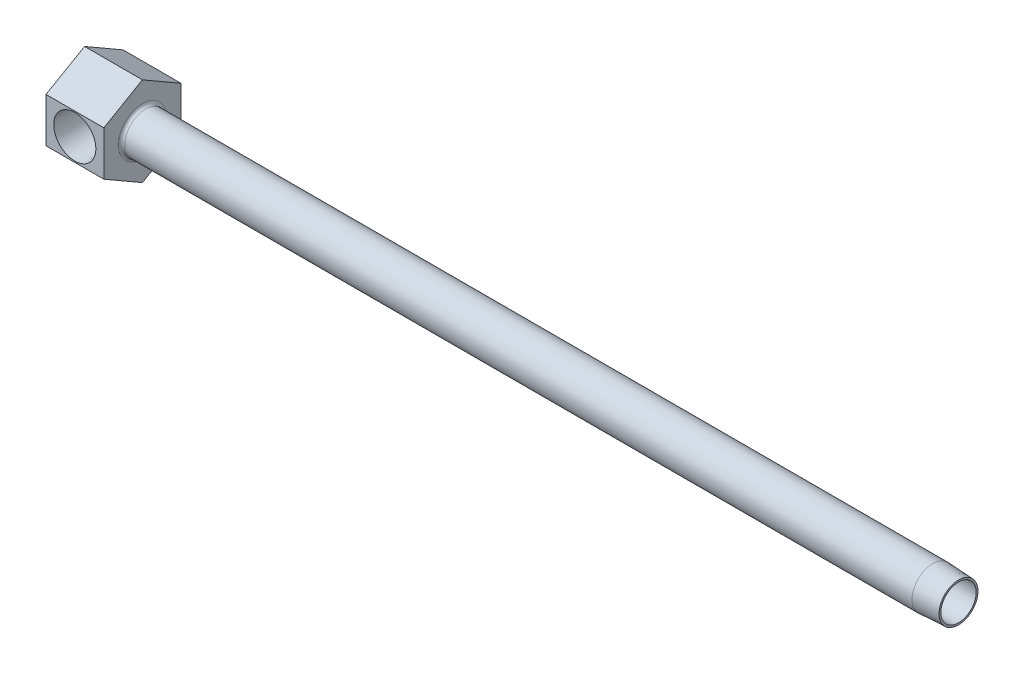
ISO-10303-21;
HEADER;
FILE_DESCRIPTION(('STEP AP214'),'2;1');
FILE_NAME('part.step','',(''),(''),'','','');
FILE_SCHEMA(('AUTOMOTIVE_DESIGN { 1 0 10303 214 1 1 1 1 }'));
ENDSEC;
DATA;
#1=APPLICATION_CONTEXT('core data for automotive mechanical design processes');
#2=APPLICATION_PROTOCOL_DEFINITION('international standard','automotive_design',2000,#1);
#3=PRODUCT_CONTEXT('',#1,'mechanical');
#4=PRODUCT('Part','Part','',(#3));
#5=PRODUCT_RELATED_PRODUCT_CATEGORY('part','',(#4));
#6=PRODUCT_DEFINITION_FORMATION('','',#4);
#7=PRODUCT_DEFINITION_CONTEXT('part definition',#1,'design');
#8=PRODUCT_DEFINITION('design','',#6,#7);
#9=PRODUCT_DEFINITION_SHAPE('','',#8);
#10=(LENGTH_UNIT() NAMED_UNIT(*) SI_UNIT(.MILLI.,.METRE.));
#11=(NAMED_UNIT(*) PLANE_ANGLE_UNIT() SI_UNIT($,.RADIAN.));
#12=(NAMED_UNIT(*) SI_UNIT($,.STERADIAN.) SOLID_ANGLE_UNIT());
#13=UNCERTAINTY_MEASURE_WITH_UNIT(LENGTH_MEASURE(1.E-05),#10,'distance_accuracy_value','');
#14=(GEOMETRIC_REPRESENTATION_CONTEXT(3) GLOBAL_UNCERTAINTY_ASSIGNED_CONTEXT((#13)) GLOBAL_UNIT_ASSIGNED_CONTEXT((#10,
#11,#12)) REPRESENTATION_CONTEXT('',''));
#15=CARTESIAN_POINT('',(0.,0.,0.));
#16=DIRECTION('',(0.,0.,1.));
#17=DIRECTION('',(1.,0.,0.));
#18=AXIS2_PLACEMENT_3D('',#15,#16,#17);
#19=CARTESIAN_POINT('',(7.14375,0.,9.525));
#20=DIRECTION('',(1.,0.,0.));
#21=DIRECTION('',(0.,0.,-1.));
#22=AXIS2_PLACEMENT_3D('',#19,#20,#21);
#23=PLANE('',#22);
#24=DIRECTION('',(0.,0.,1.));
#25=VECTOR('',#24,1.);
#26=CARTESIAN_POINT('',(7.14375,4.21628045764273,19.05));
#27=LINE('',#26,#25);
#28=CARTESIAN_POINT('',(7.14375,4.21628045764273,8.39289543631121));
#29=VERTEX_POINT('',#28);
#30=CARTESIAN_POINT('',(7.14375,4.21628045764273,10.16));
#31=VERTEX_POINT('',#30);
#32=EDGE_CURVE('E280',#29,#31,#27,.T.);
#33=ORIENTED_EDGE('',*,*,#32,.F.);
#34=CARTESIAN_POINT('',(7.14375,0.,9.525));
#35=DIRECTION('',(1.,0.,0.));
#36=DIRECTION('',(0.,0.,-1.));
#37=AXIS2_PLACEMENT_3D('',#34,#35,#36);
#38=CIRCLE('',#37,4.365625);
#39=CARTESIAN_POINT('',(7.14375,4.31919629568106,10.16));
#40=VERTEX_POINT('',#39);
#41=EDGE_CURVE('E163',#29,#40,#38,.T.);
#42=ORIENTED_EDGE('',*,*,#41,.T.);
#43=DIRECTION('',(0.,1.,0.));
#44=VECTOR('',#43,1.);
#45=CARTESIAN_POINT('',(7.14375,0.,10.16));
#46=LINE('',#45,#44);
#47=EDGE_CURVE('E153',#31,#40,#46,.T.);
#48=ORIENTED_EDGE('',*,*,#47,.F.);
#49=EDGE_LOOP('',(#33,#42,#48));
#50=FACE_BOUND('',#49,.T.);
#51=ADVANCED_FACE('F15',(#50),#23,.T.);
#52=CARTESIAN_POINT('',(14.2875,5.4992613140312,19.05));
#53=DIRECTION('',(0.,0.,-1.));
#54=DIRECTION('',(-1.,0.,0.));
#55=AXIS2_PLACEMENT_3D('',#52,#53,#54);
#56=PLANE('',#55);
#57=CARTESIAN_POINT('',(7.112,0.,19.05));
#58=DIRECTION('',(0.,0.,1.));
#59=DIRECTION('',(1.,0.,0.));
#60=AXIS2_PLACEMENT_3D('',#57,#58,#59);
#61=CIRCLE('',#60,5.2023645);
#62=CARTESIAN_POINT('',(12.3143645,0.,19.05));
#63=VERTEX_POINT('',#62);
#64=EDGE_CURVE('E269',#63,#63,#61,.T.);
#65=ORIENTED_EDGE('',*,*,#64,.F.);
#66=EDGE_LOOP('',(#65));
#67=FACE_BOUND('',#66,.T.);
#68=DIRECTION('',(0.,-1.,0.));
#69=VECTOR('',#68,1.);
#70=CARTESIAN_POINT('',(0.,5.4992613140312,19.05));
#71=LINE('',#70,#69);
#72=CARTESIAN_POINT('',(0.,5.4992613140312,19.05));
#73=VERTEX_POINT('',#72);
#74=CARTESIAN_POINT('',(0.,-5.49926131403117,19.05));
#75=VERTEX_POINT('',#74);
#76=EDGE_CURVE('E178',#73,#75,#71,.T.);
#77=ORIENTED_EDGE('',*,*,#76,.T.);
#78=DIRECTION('',(-1.,0.,0.));
#79=VECTOR('',#78,1.);
#80=CARTESIAN_POINT('',(14.2875,-5.49926131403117,19.05));
#81=LINE('',#80,#79);
#82=CARTESIAN_POINT('',(14.2875,-5.49926131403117,19.05));
#83=VERTEX_POINT('',#82);
#84=EDGE_CURVE('E201',#83,#75,#81,.T.);
#85=ORIENTED_EDGE('',*,*,#84,.F.);
#86=DIRECTION('',(0.,-1.,0.));
#87=VECTOR('',#86,1.);
#88=CARTESIAN_POINT('',(14.2875,5.4992613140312,19.05));
#89=LINE('',#88,#87);
#90=CARTESIAN_POINT('',(14.2875,5.4992613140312,19.05));
#91=VERTEX_POINT('',#90);
#92=EDGE_CURVE('E194',#91,#83,#89,.T.);
#93=ORIENTED_EDGE('',*,*,#92,.F.);
#94=DIRECTION('',(-1.,0.,0.));
#95=VECTOR('',#94,1.);
#96=CARTESIAN_POINT('',(14.2875,5.4992613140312,19.05));
#97=LINE('',#96,#95);
#98=EDGE_CURVE('E204',#91,#73,#97,.T.);
#99=ORIENTED_EDGE('',*,*,#98,.T.);
#100=EDGE_LOOP('',(#77,#85,#93,#99));
#101=FACE_BOUND('',#100,.T.);
#102=ADVANCED_FACE('F119',(#67,#101),#56,.F.);
#103=CARTESIAN_POINT('',(14.2875,-5.49926131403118,0.));
#104=DIRECTION('',(1.,0.,0.));
#105=DIRECTION('',(0.,1.,0.));
#106=AXIS2_PLACEMENT_3D('',#103,#104,#105);
#107=PLANE('',#106);
#108=CARTESIAN_POINT('',(14.2875,0.,9.525));
#109=DIRECTION('',(1.,0.,0.));
#110=DIRECTION('',(0.,1.,0.));
#111=AXIS2_PLACEMENT_3D('',#108,#109,#110);
#112=CIRCLE('',#111,5.9309);
#113=CARTESIAN_POINT('',(14.2875,5.9309,9.525));
#114=VERTEX_POINT('',#113);
#115=EDGE_CURVE('E216',#114,#114,#112,.F.);
#116=ORIENTED_EDGE('',*,*,#115,.T.);
#117=EDGE_LOOP('',(#116));
#118=FACE_BOUND('',#117,.T.);
#119=DIRECTION('',(0.,0.5,-0.866025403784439));
#120=VECTOR('',#119,1.);
#121=CARTESIAN_POINT('',(14.2875,-10.9985226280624,9.525));
#122=LINE('',#121,#120);
#123=CARTESIAN_POINT('',(14.2875,-10.9985226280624,9.525));
#124=VERTEX_POINT('',#123);
#125=CARTESIAN_POINT('',(14.2875,-5.49926131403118,0.));
#126=VERTEX_POINT('',#125);
#127=EDGE_CURVE('E184',#124,#126,#122,.T.);
#128=ORIENTED_EDGE('',*,*,#127,.T.);
#129=DIRECTION('',(0.,1.,0.));
#130=VECTOR('',#129,1.);
#131=CARTESIAN_POINT('',(14.2875,-5.49926131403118,0.));
#132=LINE('',#131,#130);
#133=CARTESIAN_POINT('',(14.2875,5.49926131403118,0.));
#134=VERTEX_POINT('',#133);
#135=EDGE_CURVE('E188',#126,#134,#132,.T.);
#136=ORIENTED_EDGE('',*,*,#135,.T.);
#137=DIRECTION('',(0.,0.5,0.866025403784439));
#138=VECTOR('',#137,1.);
#139=CARTESIAN_POINT('',(14.2875,5.49926131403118,0.));
#140=LINE('',#139,#138);
#141=CARTESIAN_POINT('',(14.2875,10.9985226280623,9.525));
#142=VERTEX_POINT('',#141);
#143=EDGE_CURVE('E190',#134,#142,#140,.T.);
#144=ORIENTED_EDGE('',*,*,#143,.T.);
#145=DIRECTION('',(0.,-0.5,0.86602540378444));
#146=VECTOR('',#145,1.);
#147=CARTESIAN_POINT('',(14.2875,10.9985226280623,9.525));
#148=LINE('',#147,#146);
#149=EDGE_CURVE('E192',#142,#91,#148,.T.);
#150=ORIENTED_EDGE('',*,*,#149,.T.);
#151=ORIENTED_EDGE('',*,*,#92,.T.);
#152=DIRECTION('',(0.,-0.5,-0.866025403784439));
#153=VECTOR('',#152,1.);
#154=CARTESIAN_POINT('',(14.2875,-5.49926131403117,19.05));
#155=LINE('',#154,#153);
#156=EDGE_CURVE('E38',#83,#124,#155,.T.);
#157=ORIENTED_EDGE('',*,*,#156,.T.);
#158=EDGE_LOOP('',(#128,#136,#144,#150,#151,#157));
#159=FACE_BOUND('',#158,.T.);
#160=ADVANCED_FACE('F127',(#118,#159),#107,.T.);
#161=CARTESIAN_POINT('',(14.2875,-10.9985226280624,9.525));
#162=DIRECTION('',(0.,0.866025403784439,0.5));
#163=DIRECTION('',(0.,-0.5,0.866025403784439));
#164=AXIS2_PLACEMENT_3D('',#161,#162,#163);
#165=PLANE('',#164);
#166=DIRECTION('',(0.,0.5,-0.866025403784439));
#167=VECTOR('',#166,1.);
#168=CARTESIAN_POINT('',(0.,-10.9985226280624,9.525));
#169=LINE('',#168,#167);
#170=CARTESIAN_POINT('',(0.,-10.9985226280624,9.525));
#171=VERTEX_POINT('',#170);
#172=CARTESIAN_POINT('',(0.,-5.49926131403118,0.));
#173=VERTEX_POINT('',#172);
#174=EDGE_CURVE('E166',#171,#173,#169,.T.);
#175=ORIENTED_EDGE('',*,*,#174,.T.);
#176=DIRECTION('',(-1.,0.,0.));
#177=VECTOR('',#176,1.);
#178=CARTESIAN_POINT('',(14.2875,-5.49926131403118,0.));
#179=LINE('',#178,#177);
#180=EDGE_CURVE('E213',#126,#173,#179,.T.);
#181=ORIENTED_EDGE('',*,*,#180,.F.);
#182=ORIENTED_EDGE('',*,*,#127,.F.);
#183=DIRECTION('',(-1.,0.,0.));
#184=VECTOR('',#183,1.);
#185=CARTESIAN_POINT('',(14.2875,-10.9985226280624,9.525));
#186=LINE('',#185,#184);
#187=EDGE_CURVE('E197',#124,#171,#186,.T.);
#188=ORIENTED_EDGE('',*,*,#187,.T.);
#189=EDGE_LOOP('',(#175,#181,#182,#188));
#190=FACE_BOUND('',#189,.T.);
#191=ADVANCED_FACE('F301',(#190),#165,.F.);
#192=CARTESIAN_POINT('',(14.2875,-5.49926131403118,0.));
#193=DIRECTION('',(0.,0.,1.));
#194=DIRECTION('',(0.,-1.,0.));
#195=AXIS2_PLACEMENT_3D('',#192,#193,#194);
#196=PLANE('',#195);
#197=DIRECTION('',(0.,1.,0.));
#198=VECTOR('',#197,1.);
#199=CARTESIAN_POINT('',(0.,-5.49926131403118,0.));
#200=LINE('',#199,#198);
#201=CARTESIAN_POINT('',(0.,5.49926131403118,0.));
#202=VERTEX_POINT('',#201);
#203=EDGE_CURVE('E169',#173,#202,#200,.T.);
#204=ORIENTED_EDGE('',*,*,#203,.T.);
#205=DIRECTION('',(-1.,0.,0.));
#206=VECTOR('',#205,1.);
#207=CARTESIAN_POINT('',(14.2875,5.49926131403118,0.));
#208=LINE('',#207,#206);
#209=EDGE_CURVE('E210',#134,#202,#208,.T.);
#210=ORIENTED_EDGE('',*,*,#209,.F.);
#211=ORIENTED_EDGE('',*,*,#135,.F.);
#212=ORIENTED_EDGE('',*,*,#180,.T.);
#213=EDGE_LOOP('',(#204,#210,#211,#212));
#214=FACE_BOUND('',#213,.T.);
#215=ADVANCED_FACE('F307',(#214),#196,.F.);
#216=CARTESIAN_POINT('',(14.2875,5.49926131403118,0.));
#217=DIRECTION('',(0.,-0.866025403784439,0.5));
#218=DIRECTION('',(0.,-0.5,-0.866025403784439));
#219=AXIS2_PLACEMENT_3D('',#216,#217,#218);
#220=PLANE('',#219);
#221=DIRECTION('',(0.,0.5,0.866025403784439));
#222=VECTOR('',#221,1.);
#223=CARTESIAN_POINT('',(0.,5.49926131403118,0.));
#224=LINE('',#223,#222);
#225=CARTESIAN_POINT('',(0.,10.9985226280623,9.525));
#226=VERTEX_POINT('',#225);
#227=EDGE_CURVE('E172',#202,#226,#224,.T.);
#228=ORIENTED_EDGE('',*,*,#227,.T.);
#229=DIRECTION('',(-1.,0.,0.));
#230=VECTOR('',#229,1.);
#231=CARTESIAN_POINT('',(14.2875,10.9985226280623,9.525));
#232=LINE('',#231,#230);
#233=EDGE_CURVE('E207',#142,#226,#232,.T.);
#234=ORIENTED_EDGE('',*,*,#233,.F.);
#235=ORIENTED_EDGE('',*,*,#143,.F.);
#236=ORIENTED_EDGE('',*,*,#209,.T.);
#237=EDGE_LOOP('',(#228,#234,#235,#236));
#238=FACE_BOUND('',#237,.T.);
#239=ADVANCED_FACE('F309',(#238),#220,.F.);
#240=CARTESIAN_POINT('',(14.2875,10.9985226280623,9.525));
#241=DIRECTION('',(0.,-0.86602540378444,-0.5));
#242=DIRECTION('',(0.,0.5,-0.86602540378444));
#243=AXIS2_PLACEMENT_3D('',#240,#241,#242);
#244=PLANE('',#243);
#245=DIRECTION('',(0.,-0.5,0.86602540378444));
#246=VECTOR('',#245,1.);
#247=CARTESIAN_POINT('',(0.,10.9985226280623,9.525));
#248=LINE('',#247,#246);
#249=EDGE_CURVE('E175',#226,#73,#248,.T.);
#250=ORIENTED_EDGE('',*,*,#249,.T.);
#251=ORIENTED_EDGE('',*,*,#98,.F.);
#252=ORIENTED_EDGE('',*,*,#149,.F.);
#253=ORIENTED_EDGE('',*,*,#233,.T.);
#254=EDGE_LOOP('',(#250,#251,#252,#253));
#255=FACE_BOUND('',#254,.T.);
#256=ADVANCED_FACE('F312',(#255),#244,.F.);
#257=CARTESIAN_POINT('',(14.2875,-5.49926131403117,19.05));
#258=DIRECTION('',(0.,0.866025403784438,-0.5));
#259=DIRECTION('',(0.,0.5,0.866025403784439));
#260=AXIS2_PLACEMENT_3D('',#257,#258,#259);
#261=PLANE('',#260);
#262=DIRECTION('',(0.,-0.5,-0.866025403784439));
#263=VECTOR('',#262,1.);
#264=CARTESIAN_POINT('',(0.,-5.49926131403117,19.05));
#265=LINE('',#264,#263);
#266=EDGE_CURVE('E181',#75,#171,#265,.T.);
#267=ORIENTED_EDGE('',*,*,#266,.T.);
#268=ORIENTED_EDGE('',*,*,#187,.F.);
#269=ORIENTED_EDGE('',*,*,#156,.F.);
#270=ORIENTED_EDGE('',*,*,#84,.T.);
#271=EDGE_LOOP('',(#267,#268,#269,#270));
#272=FACE_BOUND('',#271,.T.);
#273=ADVANCED_FACE('F296',(#272),#261,.F.);
#274=CARTESIAN_POINT('',(0.,-5.49926131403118,0.));
#275=DIRECTION('',(1.,0.,0.));
#276=DIRECTION('',(0.,1.,0.));
#277=AXIS2_PLACEMENT_3D('',#274,#275,#276);
#278=PLANE('',#277);
#279=ORIENTED_EDGE('',*,*,#174,.F.);
#280=ORIENTED_EDGE('',*,*,#266,.F.);
#281=ORIENTED_EDGE('',*,*,#76,.F.);
#282=ORIENTED_EDGE('',*,*,#249,.F.);
#283=ORIENTED_EDGE('',*,*,#227,.F.);
#284=ORIENTED_EDGE('',*,*,#203,.F.);
#285=EDGE_LOOP('',(#279,#280,#281,#282,#283,#284));
#286=FACE_BOUND('',#285,.T.);
#287=ADVANCED_FACE('F141',(#286),#278,.F.);
#288=CARTESIAN_POINT('',(68.0114010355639,0.,9.525));
#289=DIRECTION('',(-1.,0.,0.));
#290=DIRECTION('',(0.,0.,1.));
#291=AXIS2_PLACEMENT_3D('',#288,#289,#290);
#292=CYLINDRICAL_SURFACE('',#291,5.1435);
#293=CARTESIAN_POINT('',(209.55,0.,9.525));
#294=DIRECTION('',(-1.,0.,0.));
#295=DIRECTION('',(0.,0.,1.));
#296=AXIS2_PLACEMENT_3D('',#293,#294,#295);
#297=CIRCLE('',#296,5.1435);
#298=CARTESIAN_POINT('',(209.55,0.,14.6685));
#299=VERTEX_POINT('',#298);
#300=EDGE_CURVE('E10',#299,#299,#297,.F.);
#301=ORIENTED_EDGE('',*,*,#300,.F.);
#302=EDGE_LOOP('',(#301));
#303=FACE_BOUND('',#302,.T.);
#304=CARTESIAN_POINT('',(15.0749,0.,9.525));
#305=DIRECTION('',(1.,0.,0.));
#306=DIRECTION('',(0.,1.,0.));
#307=AXIS2_PLACEMENT_3D('',#304,#305,#306);
#308=CIRCLE('',#307,5.1435);
#309=CARTESIAN_POINT('',(15.0749,5.1435,9.525));
#310=VERTEX_POINT('',#309);
#311=EDGE_CURVE('E219',#310,#310,#308,.T.);
#312=ORIENTED_EDGE('',*,*,#311,.T.);
#313=EDGE_LOOP('',(#312));
#314=FACE_BOUND('',#313,.T.);
#315=ADVANCED_FACE('F17',(#303,#314),#292,.T.);
#316=CARTESIAN_POINT('',(7.14375,-4.31919629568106,10.16));
#317=VERTEX_POINT('',#316);
#318=CARTESIAN_POINT('',(7.14375,-4.21628045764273,10.16));
#319=VERTEX_POINT('',#318);
#320=EDGE_CURVE('E146',#317,#319,#46,.T.);
#321=ORIENTED_EDGE('',*,*,#320,.F.);
#322=CARTESIAN_POINT('',(7.14375,-4.21628045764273,8.39289543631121));
#323=VERTEX_POINT('',#322);
#324=EDGE_CURVE('E148',#317,#323,#38,.T.);
#325=ORIENTED_EDGE('',*,*,#324,.T.);
#326=DIRECTION('',(0.,0.,1.));
#327=VECTOR('',#326,1.);
#328=CARTESIAN_POINT('',(7.14375,-4.21628045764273,19.05));
#329=LINE('',#328,#327);
#330=EDGE_CURVE('E149',#319,#323,#329,.F.);
#331=ORIENTED_EDGE('',*,*,#330,.F.);
#332=EDGE_LOOP('',(#321,#325,#331));
#333=FACE_BOUND('',#332,.T.);
#334=ADVANCED_FACE('F122',(#333),#23,.T.);
#335=CARTESIAN_POINT('',(66.1375087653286,0.,9.525));
#336=DIRECTION('',(1.,0.,0.));
#337=DIRECTION('',(0.,0.,-1.));
#338=AXIS2_PLACEMENT_3D('',#335,#336,#337);
#339=CYLINDRICAL_SURFACE('',#338,4.365625);
#340=DIRECTION('',(1.,0.,0.));
#341=VECTOR('',#340,1.);
#342=CARTESIAN_POINT('',(66.1375087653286,4.31919629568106,10.16));
#343=LINE('',#342,#341);
#344=CARTESIAN_POINT('',(9.50166012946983,4.31919629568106,10.16));
#345=VERTEX_POINT('',#344);
#346=EDGE_CURVE('E23',#40,#345,#343,.T.);
#347=ORIENTED_EDGE('',*,*,#346,.F.);
#348=ORIENTED_EDGE('',*,*,#41,.F.);
#349=CARTESIAN_POINT('',(11.0152606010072,1.5945487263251,5.461));
#350=CARTESIAN_POINT('',(10.9690910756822,1.7075595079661,5.50534166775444));
#351=CARTESIAN_POINT('',(10.9186455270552,1.81703423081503,5.55373339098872));
#352=CARTESIAN_POINT('',(10.810302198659,2.02846645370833,5.65746242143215));
#353=CARTESIAN_POINT('',(10.7524192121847,2.13043826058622,5.71278593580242));
#354=CARTESIAN_POINT('',(10.5698905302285,2.42358040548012,5.88682744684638));
#355=CARTESIAN_POINT('',(10.4356317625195,2.6037024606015,6.01432367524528));
#356=CARTESIAN_POINT('',(10.2004726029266,2.87382153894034,6.2358690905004));
#357=CARTESIAN_POINT('',(10.1051285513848,2.97281573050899,6.32528321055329));
#358=CARTESIAN_POINT('',(9.90783434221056,3.15907014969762,6.50903483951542));
#359=CARTESIAN_POINT('',(9.80588273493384,3.2463277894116,6.60337342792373));
#360=CARTESIAN_POINT('',(9.59613587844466,3.40951469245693,6.79556583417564));
#361=CARTESIAN_POINT('',(9.48833347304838,3.48542963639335,6.89342390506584));
#362=CARTESIAN_POINT('',(9.26745878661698,3.62617881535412,7.09103053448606));
#363=CARTESIAN_POINT('',(9.15438825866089,3.69101670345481,7.19077845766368));
#364=CARTESIAN_POINT('',(8.91700112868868,3.81296593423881,7.39547820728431));
#365=CARTESIAN_POINT('',(8.79240497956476,3.86952009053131,7.50043788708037));
#366=CARTESIAN_POINT('',(8.53587575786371,3.97111492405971,7.70779573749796));
#367=CARTESIAN_POINT('',(8.40392330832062,4.01612325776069,7.81018600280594));
#368=CARTESIAN_POINT('',(8.16304729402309,4.0847277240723,7.98226690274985));
#369=CARTESIAN_POINT('',(8.0562781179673,4.11086974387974,8.05387458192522));
#370=CARTESIAN_POINT('',(7.89027521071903,4.14432560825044,8.15224503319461));
#371=CARTESIAN_POINT('',(7.83425575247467,4.15448196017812,8.18339689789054));
#372=CARTESIAN_POINT('',(7.71975817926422,4.17277321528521,8.24142733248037));
#373=CARTESIAN_POINT('',(7.6612817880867,4.18090950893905,8.26830883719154));
#374=CARTESIAN_POINT('',(7.52931857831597,4.19631734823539,8.32062856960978));
#375=CARTESIAN_POINT('',(7.45518069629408,4.2030846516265,8.34468558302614));
#376=CARTESIAN_POINT('',(7.30234246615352,4.21282137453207,8.37996487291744));
#377=CARTESIAN_POINT('',(7.22358315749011,4.21571837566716,8.39094201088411));
#378=CARTESIAN_POINT('',(7.14374999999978,4.21628045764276,8.39289543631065));
#379=B_SPLINE_CURVE_WITH_KNOTS('',3,(#349,#350,#351,#352,#353,#354,#355,#356,#357,#358,#359,
#360,#361,#362,#363,#364,#365,#366,#367,#368,#369,#370,#371,#372,#373,#374,#375,#376,#377,#378),
.UNSPECIFIED.,.F.,.F.,(4,2,2,2,2,2,2,2,2,2,2,2,2,2,4),(0.,0.389178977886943,0.777595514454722,
1.54850925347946,2.03989074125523,2.5313804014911,3.02348538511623,3.51542776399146,
4.03226982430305,4.5505442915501,4.94339994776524,5.13792303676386,5.33231185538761,
5.56585330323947,5.80370611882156),.UNSPECIFIED.);
#380=CARTESIAN_POINT('',(11.0152606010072,1.5945487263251,5.461));
#381=VERTEX_POINT('',#380);
#382=EDGE_CURVE('E222',#381,#29,#379,.T.);
#383=ORIENTED_EDGE('',*,*,#382,.F.);
#384=CARTESIAN_POINT('',(11.038608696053,-1.66986531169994,5.4913625));
#385=CARTESIAN_POINT('',(11.0105354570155,-1.5831922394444,5.45544731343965));
#386=CARTESIAN_POINT('',(10.985979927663,-1.49442111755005,5.422003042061));
#387=CARTESIAN_POINT('',(10.9431209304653,-1.31365154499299,5.36062405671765));
#388=CARTESIAN_POINT('',(10.9248095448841,-1.22165734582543,5.3326823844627));
#389=CARTESIAN_POINT('',(10.8936059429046,-1.03529168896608,5.28281066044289));
#390=CARTESIAN_POINT('',(10.8807075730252,-0.94092306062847,5.26087379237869));
#391=CARTESIAN_POINT('',(10.8594086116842,-0.750424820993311,5.22325970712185));
#392=CARTESIAN_POINT('',(10.8510094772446,-0.654294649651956,5.20758451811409));
#393=CARTESIAN_POINT('',(10.8381415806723,-0.463156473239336,5.18296779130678));
#394=CARTESIAN_POINT('',(10.8335877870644,-0.368172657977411,5.1738812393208));
#395=CARTESIAN_POINT('',(10.8276558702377,-0.177678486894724,5.16194794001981));
#396=CARTESIAN_POINT('',(10.8262790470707,-0.0821679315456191,5.15910374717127));
#397=CARTESIAN_POINT('',(10.826564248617,0.108822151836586,5.15968693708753));
#398=CARTESIAN_POINT('',(10.828226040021,0.204301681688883,5.16311383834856));
#399=CARTESIAN_POINT('',(10.8347557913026,0.3946850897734,5.17620642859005));
#400=CARTESIAN_POINT('',(10.8396224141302,0.489589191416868,5.18586951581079));
#401=CARTESIAN_POINT('',(10.8530224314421,0.678329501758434,5.2113452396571));
#402=CARTESIAN_POINT('',(10.861556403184,0.772165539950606,5.22715884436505));
#403=CARTESIAN_POINT('',(10.882977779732,0.958108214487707,5.26475262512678));
#404=CARTESIAN_POINT('',(10.8958637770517,1.05021539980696,5.28653087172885));
#405=CARTESIAN_POINT('',(10.9268394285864,1.23213175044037,5.33579934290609));
#406=CARTESIAN_POINT('',(10.9449350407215,1.32193815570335,5.36329609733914));
#407=CARTESIAN_POINT('',(10.9870994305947,1.49845562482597,5.42352620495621));
#408=CARTESIAN_POINT('',(11.0111754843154,1.58516276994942,5.45626591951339));
#409=CARTESIAN_POINT('',(11.038608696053,1.66986531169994,5.4913625));
#410=B_SPLINE_CURVE_WITH_KNOTS('',3,(#384,#385,#386,#387,#388,#389,#390,#391,#392,#393,#394,
#395,#396,#397,#398,#399,#400,#401,#402,#403,#404,#405,#406,#407,#408,#409),.UNSPECIFIED.,.F.,
.F.,(4,2,2,2,2,2,2,2,2,2,2,2,4),(0.,0.293591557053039,0.586809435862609,0.879693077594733,
1.17267150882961,1.45898777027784,1.74542117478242,2.03183258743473,2.31812458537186,
2.60446166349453,2.89070622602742,3.17727945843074,3.46420306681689),.UNSPECIFIED.);
#411=CARTESIAN_POINT('',(11.0152606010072,-1.5945487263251,5.461));
#412=VERTEX_POINT('',#411);
#413=EDGE_CURVE('E227',#412,#381,#410,.T.);
#414=ORIENTED_EDGE('',*,*,#413,.F.);
#415=CARTESIAN_POINT('',(7.14375,-4.21628045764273,8.39289543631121));
#416=CARTESIAN_POINT('',(7.18362399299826,-4.21598583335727,8.39181806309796));
#417=CARTESIAN_POINT('',(7.22338201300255,-4.21511517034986,8.38855660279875));
#418=CARTESIAN_POINT('',(7.30220974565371,-4.21229002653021,8.3781194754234));
#419=CARTESIAN_POINT('',(7.34128135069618,-4.21033927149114,8.37095726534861));
#420=CARTESIAN_POINT('',(7.45558593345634,-4.20306181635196,8.34463096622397));
#421=CARTESIAN_POINT('',(7.52959005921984,-4.19629141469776,8.32054287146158));
#422=CARTESIAN_POINT('',(7.67793141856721,-4.17895935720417,8.2616842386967));
#423=CARTESIAN_POINT('',(7.75200183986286,-4.16818767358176,8.22634138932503));
#424=CARTESIAN_POINT('',(7.89635080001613,-4.14345087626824,8.14945009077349));
#425=CARTESIAN_POINT('',(7.96662283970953,-4.12948049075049,8.10789143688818));
#426=CARTESIAN_POINT('',(8.10525974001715,-4.09836535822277,8.02024615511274));
#427=CARTESIAN_POINT('',(8.17357097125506,-4.08117012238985,7.97409391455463));
#428=CARTESIAN_POINT('',(8.30769836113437,-4.04390532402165,7.87936489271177));
#429=CARTESIAN_POINT('',(8.37351346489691,-4.02383456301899,7.83078710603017));
#430=CARTESIAN_POINT('',(8.57859672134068,-3.95588469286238,7.67482924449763));
#431=CARTESIAN_POINT('',(8.71418056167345,-3.90283307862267,7.56482866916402));
#432=CARTESIAN_POINT('',(8.97841531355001,-3.78358080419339,7.34346052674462));
#433=CARTESIAN_POINT('',(9.10705932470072,-3.71736735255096,7.23209172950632));
#434=CARTESIAN_POINT('',(9.35705912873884,-3.57190642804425,7.01153592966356));
#435=CARTESIAN_POINT('',(9.47845600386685,-3.49274436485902,6.90233956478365));
#436=CARTESIAN_POINT('',(9.71438396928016,-3.32067953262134,6.68762551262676));
#437=CARTESIAN_POINT('',(9.82891987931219,-3.22778657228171,6.58210526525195));
#438=CARTESIAN_POINT('',(10.0969445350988,-2.98549279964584,6.33327532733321));
#439=CARTESIAN_POINT('',(10.2465325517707,-2.82876640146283,6.19275827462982));
#440=CARTESIAN_POINT('',(10.5251240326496,-2.48539491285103,5.92944140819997));
#441=CARTESIAN_POINT('',(10.6541872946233,-2.29884003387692,5.80659022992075));
#442=CARTESIAN_POINT('',(10.815064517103,-2.01834728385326,5.65289947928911));
#443=CARTESIAN_POINT('',(10.8584525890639,-1.93670806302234,5.61137999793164));
#444=CARTESIAN_POINT('',(10.9405236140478,-1.76894321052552,5.53274400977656));
#445=CARTESIAN_POINT('',(10.9792015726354,-1.6828129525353,5.49563217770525));
#446=CARTESIAN_POINT('',(11.0152606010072,-1.5945487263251,5.461));
#447=B_SPLINE_CURVE_WITH_KNOTS('',3,(#415,#416,#417,#418,#419,#420,#421,#422,#423,#424,#425,
#426,#427,#428,#429,#430,#431,#432,#433,#434,#435,#436,#437,#438,#439,#440,#441,#442,#443,#444,
#445,#446),.UNSPECIFIED.,.F.,.F.,(4,2,2,2,2,2,2,2,2,2,2,2,2,2,2,4),(0.,0.119524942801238,
0.238640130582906,0.471907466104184,0.719716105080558,0.967936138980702,1.2204276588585,
1.47302472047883,2.01967972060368,2.56686861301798,3.1105838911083,3.65391262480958,
4.4259772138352,5.19574951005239,5.49953103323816,5.80363192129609),.UNSPECIFIED.);
#448=EDGE_CURVE('E162',#323,#412,#447,.T.);
#449=ORIENTED_EDGE('',*,*,#448,.F.);
#450=ORIENTED_EDGE('',*,*,#324,.F.);
#451=DIRECTION('',(1.,0.,0.));
#452=VECTOR('',#451,1.);
#453=CARTESIAN_POINT('',(66.1375087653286,-4.31919629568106,10.16));
#454=LINE('',#453,#452);
#455=CARTESIAN_POINT('',(9.50166012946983,-4.31919629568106,10.16));
#456=VERTEX_POINT('',#455);
#457=EDGE_CURVE('E160',#456,#317,#454,.F.);
#458=ORIENTED_EDGE('',*,*,#457,.F.);
#459=CARTESIAN_POINT('',(9.50159462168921,4.31922569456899,10.1598));
#460=CARTESIAN_POINT('',(9.52205476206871,4.31004461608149,10.2222542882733));
#461=CARTESIAN_POINT('',(9.54440879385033,4.29961032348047,10.2838517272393));
#462=CARTESIAN_POINT('',(9.592244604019,4.27639816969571,10.4052958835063));
#463=CARTESIAN_POINT('',(9.61772301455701,4.26362282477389,10.4651444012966));
#464=CARTESIAN_POINT('',(9.6977084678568,4.22211002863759,10.641720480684));
#465=CARTESIAN_POINT('',(9.75594525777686,4.19010742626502,10.7559937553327));
#466=CARTESIAN_POINT('',(9.87844694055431,4.11827910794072,10.9783012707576));
#467=CARTESIAN_POINT('',(9.94270165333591,4.07846648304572,11.0863455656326));
#468=CARTESIAN_POINT('',(10.0748723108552,3.9913538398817,11.2972300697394));
#469=CARTESIAN_POINT('',(10.1427929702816,3.94404402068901,11.4000632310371));
#470=CARTESIAN_POINT('',(10.298774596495,3.82856370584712,11.6276502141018));
#471=CARTESIAN_POINT('',(10.3873705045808,3.75819622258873,11.7509249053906));
#472=CARTESIAN_POINT('',(10.5646676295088,3.60591330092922,11.9899830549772));
#473=CARTESIAN_POINT('',(10.6533688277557,3.52399966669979,12.1057676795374));
#474=CARTESIAN_POINT('',(10.828903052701,3.34837324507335,12.3298815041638));
#475=CARTESIAN_POINT('',(10.9157338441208,3.25464716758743,12.4382020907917));
#476=CARTESIAN_POINT('',(11.0854790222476,3.05533823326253,12.6465978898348));
#477=CARTESIAN_POINT('',(11.1683947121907,2.94975936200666,12.746675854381));
#478=CARTESIAN_POINT('',(11.3637298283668,2.67738871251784,12.9797077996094));
#479=CARTESIAN_POINT('',(11.4730979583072,2.50408908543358,13.1077769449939));
#480=CARTESIAN_POINT('',(11.6736784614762,2.13317678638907,13.3402290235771));
#481=CARTESIAN_POINT('',(11.764930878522,1.93561933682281,13.444664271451));
#482=CARTESIAN_POINT('',(11.9092563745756,1.55445058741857,13.608817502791));
#483=CARTESIAN_POINT('',(11.9662034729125,1.37434002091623,13.6731460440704));
#484=CARTESIAN_POINT('',(12.036275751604,1.09545803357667,13.7520594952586));
#485=CARTESIAN_POINT('',(12.0570798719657,1.00100886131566,13.7754393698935));
#486=CARTESIAN_POINT('',(12.093196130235,0.80976989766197,13.8159777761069));
#487=CARTESIAN_POINT('',(12.1085105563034,0.712981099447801,13.8331388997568));
#488=CARTESIAN_POINT('',(12.1334016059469,0.517219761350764,13.861011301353));
#489=CARTESIAN_POINT('',(12.1429475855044,0.418238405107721,13.8716881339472));
#490=CARTESIAN_POINT('',(12.1559671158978,0.219418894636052,13.8862461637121));
#491=CARTESIAN_POINT('',(12.159443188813,0.119581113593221,13.8901301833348));
#492=CARTESIAN_POINT('',(12.1602489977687,-0.0801622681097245,13.8910308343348));
#493=CARTESIAN_POINT('',(12.157578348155,-0.180067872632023,13.8880470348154));
#494=CARTESIAN_POINT('',(12.1461610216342,-0.379063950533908,13.87528173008));
#495=CARTESIAN_POINT('',(12.1374146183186,-0.478154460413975,13.8655005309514));
#496=CARTESIAN_POINT('',(12.1041501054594,-0.757548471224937,13.8282625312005));
#497=CARTESIAN_POINT('',(12.0725539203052,-0.936048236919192,13.7928583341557));
#498=CARTESIAN_POINT('',(11.9914510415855,-1.28332325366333,13.701614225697));
#499=CARTESIAN_POINT('',(11.9419389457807,-1.45209555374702,13.645768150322));
#500=CARTESIAN_POINT('',(11.8234161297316,-1.78986703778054,13.5113020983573));
#501=CARTESIAN_POINT('',(11.7531886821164,-1.95786359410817,13.4312490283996));
#502=CARTESIAN_POINT('',(11.5990616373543,-2.2774775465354,13.2539727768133));
#503=CARTESIAN_POINT('',(11.515160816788,-2.42909347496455,13.1567480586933));
#504=CARTESIAN_POINT('',(11.2893838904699,-2.79222476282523,12.8919364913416));
#505=CARTESIAN_POINT('',(11.1405152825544,-2.99235864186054,12.7145443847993));
#506=CARTESIAN_POINT('',(10.9077049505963,-3.26312100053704,12.4281267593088));
#507=CARTESIAN_POINT('',(10.8282461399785,-3.34869576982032,12.3289140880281));
#508=CARTESIAN_POINT('',(10.6676325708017,-3.51003537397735,12.1240974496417));
#509=CARTESIAN_POINT('',(10.5864785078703,-3.58580414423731,12.0184960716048));
#510=CARTESIAN_POINT('',(10.4220303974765,-3.72941202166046,11.798300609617));
#511=CARTESIAN_POINT('',(10.338734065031,-3.79700254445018,11.6835467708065));
#512=CARTESIAN_POINT('',(10.1740816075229,-3.92201333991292,11.4470806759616));
#513=CARTESIAN_POINT('',(10.092727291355,-3.97942442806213,11.3253622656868));
#514=CARTESIAN_POINT('',(9.93568225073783,-4.08324264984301,11.0754774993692));
#515=CARTESIAN_POINT('',(9.85994825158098,-4.12974154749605,10.9473767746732));
#516=CARTESIAN_POINT('',(9.71779756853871,-4.21155620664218,10.6828322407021));
#517=CARTESIAN_POINT('',(9.65135922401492,-4.24689821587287,10.5464089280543));
#518=CARTESIAN_POINT('',(9.57628126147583,-4.28419371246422,10.3652627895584));
#519=CARTESIAN_POINT('',(9.56028735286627,-4.29194911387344,10.3247361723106));
#520=CARTESIAN_POINT('',(9.52977406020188,-4.30640007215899,10.2428664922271));
#521=CARTESIAN_POINT('',(9.51525722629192,-4.31309380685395,10.2015221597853));
#522=CARTESIAN_POINT('',(9.50159462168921,-4.31922569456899,10.1598));
#523=B_SPLINE_CURVE_WITH_KNOTS('',3,(#459,#460,#461,#462,#463,#464,#465,#466,#467,#468,#469,
#470,#471,#472,#473,#474,#475,#476,#477,#478,#479,#480,#481,#482,#483,#484,#485,#486,#487,#488,
#489,#490,#491,#492,#493,#494,#495,#496,#497,#498,#499,#500,#501,#502,#503,#504,#505,#506,#507,
#508,#509,#510,#511,#512,#513,#514,#515,#516,#517,#518,#519,#520,#521,#522),.UNSPECIFIED.,.F.,
.F.,(4,2,2,2,2,2,2,2,2,2,2,2,2,2,2,2,2,2,2,2,2,2,2,2,2,2,2,2,2,2,2,4),(0.,0.19895577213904,
0.397698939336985,0.793542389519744,1.1887279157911,1.58443438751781,2.08580736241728,
2.58710208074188,3.08896592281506,3.5906615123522,4.3128774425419,5.03347872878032,
5.62940645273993,5.92758657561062,6.22564226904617,6.52526772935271,6.82476866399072,
7.12428839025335,7.4237946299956,7.97525228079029,8.52687635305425,9.12138980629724,
9.71595648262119,10.6287987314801,11.0881817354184,11.5473798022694,12.018174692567,
12.4893922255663,12.9564924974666,13.4224855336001,13.5552077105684,13.6881552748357),.UNSPECIFIED.);
#524=EDGE_CURVE('E241',#345,#456,#523,.T.);
#525=ORIENTED_EDGE('',*,*,#524,.F.);
#526=EDGE_LOOP('',(#347,#348,#383,#414,#449,#450,#458,#525));
#527=FACE_BOUND('',#526,.T.);
#528=CARTESIAN_POINT('',(215.9,0.,9.525));
#529=DIRECTION('',(1.,0.,0.));
#530=DIRECTION('',(0.,0.,-1.));
#531=AXIS2_PLACEMENT_3D('',#528,#529,#530);
#532=CIRCLE('',#531,4.365625);
#533=CARTESIAN_POINT('',(215.9,0.,5.159375));
#534=VERTEX_POINT('',#533);
#535=EDGE_CURVE('E267',#534,#534,#532,.T.);
#536=ORIENTED_EDGE('',*,*,#535,.T.);
#537=EDGE_LOOP('',(#536));
#538=FACE_BOUND('',#537,.T.);
#539=ADVANCED_FACE('F114',(#527,#538),#339,.F.);
#540=CARTESIAN_POINT('',(15.0749,0.,9.525));
#541=DIRECTION('',(1.,0.,0.));
#542=DIRECTION('',(0.,1.,0.));
#543=AXIS2_PLACEMENT_3D('',#540,#541,#542);
#544=TOROIDAL_SURFACE('',#543,5.9309,0.7874);
#545=ORIENTED_EDGE('',*,*,#311,.F.);
#546=EDGE_LOOP('',(#545));
#547=FACE_BOUND('',#546,.T.);
#548=ORIENTED_EDGE('',*,*,#115,.F.);
#549=EDGE_LOOP('',(#548));
#550=FACE_BOUND('',#549,.T.);
#551=ADVANCED_FACE('F103',(#547,#550),#544,.F.);
#552=CARTESIAN_POINT('',(7.112,0.,5.461));
#553=DIRECTION('',(0.,0.,1.));
#554=DIRECTION('',(1.,0.,0.));
#555=AXIS2_PLACEMENT_3D('',#552,#553,#554);
#556=CONICAL_SURFACE('',#555,4.2164,1.02974425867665);
#557=ORIENTED_EDGE('',*,*,#413,.T.);
#558=CARTESIAN_POINT('',(7.112,0.,5.461));
#559=DIRECTION('',(0.,0.,1.));
#560=DIRECTION('',(1.,0.,0.));
#561=AXIS2_PLACEMENT_3D('',#558,#559,#560);
#562=CIRCLE('',#561,4.2164);
#563=EDGE_CURVE('E30',#381,#412,#562,.T.);
#564=ORIENTED_EDGE('',*,*,#563,.T.);
#565=EDGE_LOOP('',(#557,#564));
#566=FACE_BOUND('',#565,.T.);
#567=CARTESIAN_POINT('',(7.112,0.,2.92753128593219));
#568=VERTEX_POINT('',#567);
#569=VERTEX_LOOP('',#568);
#570=FACE_BOUND('',#569,.T.);
#571=ADVANCED_FACE('F100',(#566,#570),#556,.F.);
#572=CARTESIAN_POINT('',(7.112,0.,19.05));
#573=DIRECTION('',(0.,0.,1.));
#574=DIRECTION('',(1.,0.,0.));
#575=AXIS2_PLACEMENT_3D('',#572,#573,#574);
#576=CYLINDRICAL_SURFACE('',#575,4.2164);
#577=ORIENTED_EDGE('',*,*,#330,.T.);
#578=ORIENTED_EDGE('',*,*,#448,.T.);
#579=ORIENTED_EDGE('',*,*,#563,.F.);
#580=ORIENTED_EDGE('',*,*,#382,.T.);
#581=ORIENTED_EDGE('',*,*,#32,.T.);
#582=CARTESIAN_POINT('',(7.112,0.,10.16));
#583=DIRECTION('',(0.,0.,1.));
#584=DIRECTION('',(1.,0.,0.));
#585=AXIS2_PLACEMENT_3D('',#582,#583,#584);
#586=CIRCLE('',#585,4.2164);
#587=EDGE_CURVE('E277',#31,#319,#586,.T.);
#588=ORIENTED_EDGE('',*,*,#587,.T.);
#589=EDGE_LOOP('',(#577,#578,#579,#580,#581,#588));
#590=FACE_BOUND('',#589,.T.);
#591=ADVANCED_FACE('F102',(#590),#576,.F.);
#592=CARTESIAN_POINT('',(11.3284,0.,10.16));
#593=DIRECTION('',(0.,0.,-1.));
#594=DIRECTION('',(-1.,0.,0.));
#595=AXIS2_PLACEMENT_3D('',#592,#593,#594);
#596=PLANE('',#595);
#597=ORIENTED_EDGE('',*,*,#47,.T.);
#598=ORIENTED_EDGE('',*,*,#346,.T.);
#599=CARTESIAN_POINT('',(7.112,0.,10.16));
#600=DIRECTION('',(0.,0.,1.));
#601=DIRECTION('',(1.,0.,0.));
#602=AXIS2_PLACEMENT_3D('',#599,#600,#601);
#603=CIRCLE('',#602,4.93618599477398);
#604=EDGE_CURVE('E274',#345,#456,#603,.T.);
#605=ORIENTED_EDGE('',*,*,#604,.T.);
#606=ORIENTED_EDGE('',*,*,#457,.T.);
#607=ORIENTED_EDGE('',*,*,#320,.T.);
#608=ORIENTED_EDGE('',*,*,#587,.F.);
#609=EDGE_LOOP('',(#597,#598,#605,#606,#607,#608));
#610=FACE_BOUND('',#609,.T.);
#611=ADVANCED_FACE('F112',(#610),#596,.F.);
#612=CARTESIAN_POINT('',(7.112,0.,19.05));
#613=DIRECTION('',(0.,0.,1.));
#614=DIRECTION('',(1.,0.,0.));
#615=AXIS2_PLACEMENT_3D('',#612,#613,#614);
#616=CONICAL_SURFACE('',#615,5.2023645,0.0299323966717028);
#617=ORIENTED_EDGE('',*,*,#524,.T.);
#618=ORIENTED_EDGE('',*,*,#604,.F.);
#619=EDGE_LOOP('',(#617,#618));
#620=FACE_BOUND('',#619,.T.);
#621=ORIENTED_EDGE('',*,*,#64,.T.);
#622=EDGE_LOOP('',(#621));
#623=FACE_BOUND('',#622,.T.);
#624=ADVANCED_FACE('F246',(#620,#623),#616,.F.);
#625=CARTESIAN_POINT('',(215.9,0.,9.525));
#626=DIRECTION('',(-1.,0.,0.));
#627=DIRECTION('',(0.,0.,1.));
#628=AXIS2_PLACEMENT_3D('',#625,#626,#627);
#629=CONICAL_SURFACE('',#628,4.81071060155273,0.052359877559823);
#630=ORIENTED_EDGE('',*,*,#300,.T.);
#631=EDGE_LOOP('',(#630));
#632=FACE_BOUND('',#631,.T.);
#633=CARTESIAN_POINT('',(215.9,0.,9.525));
#634=DIRECTION('',(1.,0.,0.));
#635=DIRECTION('',(0.,0.,-1.));
#636=AXIS2_PLACEMENT_3D('',#633,#634,#635);
#637=CIRCLE('',#636,4.81071060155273);
#638=CARTESIAN_POINT('',(215.9,0.,4.71428939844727));
#639=VERTEX_POINT('',#638);
#640=EDGE_CURVE('E264',#639,#639,#637,.T.);
#641=ORIENTED_EDGE('',*,*,#640,.F.);
#642=EDGE_LOOP('',(#641));
#643=FACE_BOUND('',#642,.T.);
#644=ADVANCED_FACE('F250',(#632,#643),#629,.T.);
#645=CARTESIAN_POINT('',(215.9,0.,5.159375));
#646=DIRECTION('',(1.,0.,0.));
#647=DIRECTION('',(0.,0.,-1.));
#648=AXIS2_PLACEMENT_3D('',#645,#646,#647);
#649=PLANE('',#648);
#650=ORIENTED_EDGE('',*,*,#640,.T.);
#651=EDGE_LOOP('',(#650));
#652=FACE_BOUND('',#651,.T.);
#653=ORIENTED_EDGE('',*,*,#535,.F.);
#654=EDGE_LOOP('',(#653));
#655=FACE_BOUND('',#654,.T.);
#656=ADVANCED_FACE('F254',(#652,#655),#649,.T.);
#657=CLOSED_SHELL('',(#51,#102,#160,#191,#215,#239,#256,#273,#287,#315,#334,#539,#551,#571,#591,
#611,#624,#644,#656));
#658=MANIFOLD_SOLID_BREP('B1',#657);
#659=ADVANCED_BREP_SHAPE_REPRESENTATION('',(#18,#658),#14);
#660=SHAPE_DEFINITION_REPRESENTATION(#9,#659);
ENDSEC;
END-ISO-10303-21;
